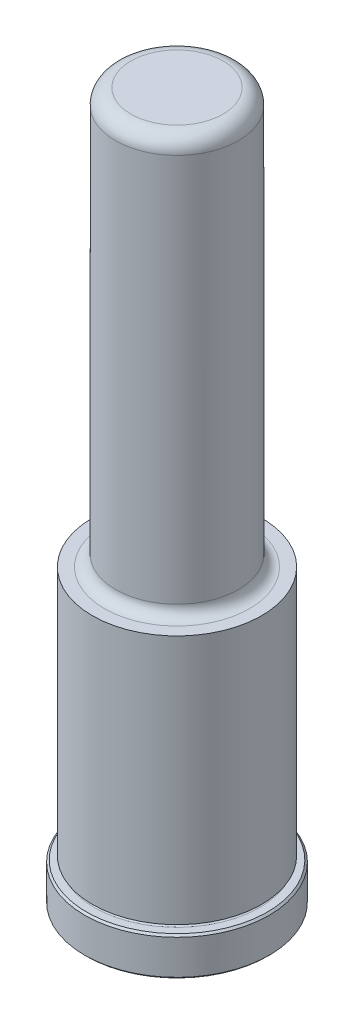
from build123d import *

# Parameters (mm, degrees)
CHAMFER1_SIZE = 0.381
FILLET7_R     = 3.175


with BuildPart() as part:
    # Sketch1 → Revolve1 (revolve)
    with BuildSketch(Plane(origin=(0, 0, 0), x_dir=(0, 0, -1), z_dir=(1, 0, 0)), mode=Mode.PRIVATE) as revolve1_sk:
        with BuildLine():
            Line((0, 0), (19.05, 0))
            Line((19.05, 0), (19.05, 7.9248))
            Line((19.05, 7.9248), (17.0688, 7.9248))
            ThreePointArc((17.0688, 7.9248), (16.6878, 8.3058), (17.0688, 8.6868))
            Line((17.0688, 8.6868), (17.4752, 8.6868))
            Line((17.4752, 8.6868), (17.4752, 60.325))
            Line((17.4752, 60.325), (14.9733, 60.325))
            ThreePointArc((14.9733, 60.325), (13.356853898, 60.994553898), (12.6873, 62.611))
            Line((12.6873, 62.611), (12.6873, 146.05))
            Line((12.6873, 146.05), (0, 146.05))
            Line((0, 146.05), (0, 0))
        make_face()
    revolve(revolve1_sk.sketch.rotate(Axis((0, 0, 0), (0, -1, 0)), 180), axis=Axis((0, 0, 0), (0, -1, 0)))

    # Chamfer1
    chamfer1_edges = [part.edges().sort_by_distance(p)[0] for p in [
        (0, 7.9248, -19.05),
        (0, 0, -19.05),
    ]]
    chamfer(chamfer1_edges, length=CHAMFER1_SIZE)

    # Fillet7
    fillet7_edges = [part.edges().sort_by_distance(p)[0] for p in [
        (0, 146.05, -12.6873),
    ]]
    fillet(fillet7_edges, radius=FILLET7_R)


solid = part.part
